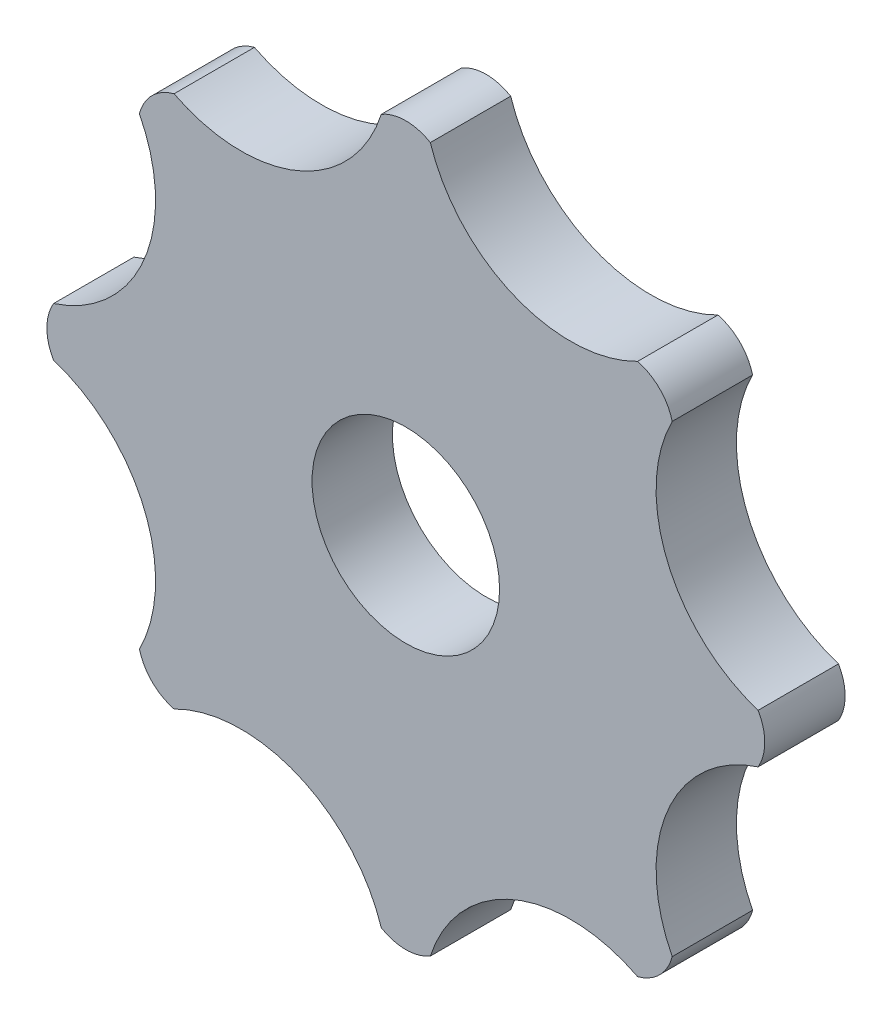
ISO-10303-21;
HEADER;
FILE_DESCRIPTION(('STEP AP214'),'2;1');
FILE_NAME('part.step','',(''),(''),'','','');
FILE_SCHEMA(('AUTOMOTIVE_DESIGN { 1 0 10303 214 1 1 1 1 }'));
ENDSEC;
DATA;
#1=APPLICATION_CONTEXT('core data for automotive mechanical design processes');
#2=APPLICATION_PROTOCOL_DEFINITION('international standard','automotive_design',2000,#1);
#3=PRODUCT_CONTEXT('',#1,'mechanical');
#4=PRODUCT('Part','Part','',(#3));
#5=PRODUCT_RELATED_PRODUCT_CATEGORY('part','',(#4));
#6=PRODUCT_DEFINITION_FORMATION('','',#4);
#7=PRODUCT_DEFINITION_CONTEXT('part definition',#1,'design');
#8=PRODUCT_DEFINITION('design','',#6,#7);
#9=PRODUCT_DEFINITION_SHAPE('','',#8);
#10=(LENGTH_UNIT() NAMED_UNIT(*) SI_UNIT(.MILLI.,.METRE.));
#11=(NAMED_UNIT(*) PLANE_ANGLE_UNIT() SI_UNIT($,.RADIAN.));
#12=(NAMED_UNIT(*) SI_UNIT($,.STERADIAN.) SOLID_ANGLE_UNIT());
#13=UNCERTAINTY_MEASURE_WITH_UNIT(LENGTH_MEASURE(1.E-05),#10,'distance_accuracy_value','');
#14=(GEOMETRIC_REPRESENTATION_CONTEXT(3) GLOBAL_UNCERTAINTY_ASSIGNED_CONTEXT((#13)) GLOBAL_UNIT_ASSIGNED_CONTEXT((#10,
#11,#12)) REPRESENTATION_CONTEXT('',''));
#15=CARTESIAN_POINT('',(0.,0.,0.));
#16=DIRECTION('',(0.,0.,1.));
#17=DIRECTION('',(1.,0.,0.));
#18=AXIS2_PLACEMENT_3D('',#15,#16,#17);
#19=CARTESIAN_POINT('',(14.8421246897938,6.14780934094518,3.));
#20=DIRECTION('',(0.,0.,-1.));
#21=DIRECTION('',(-1.,0.,0.));
#22=AXIS2_PLACEMENT_3D('',#19,#20,#21);
#23=CYLINDRICAL_SURFACE('',#22,5.5);
#24=CARTESIAN_POINT('',(14.8421246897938,6.14780934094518,0.));
#25=DIRECTION('',(0.,0.,-1.));
#26=DIRECTION('',(1.,0.,0.));
#27=AXIS2_PLACEMENT_3D('',#24,#25,#26);
#28=CIRCLE('',#27,5.5);
#29=CARTESIAN_POINT('',(13.1504175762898,0.914442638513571,0.));
#30=VERTEX_POINT('',#29);
#31=CARTESIAN_POINT('',(9.94535803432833,8.65214085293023,0.));
#32=VERTEX_POINT('',#31);
#33=EDGE_CURVE('E151',#30,#32,#28,.T.);
#34=ORIENTED_EDGE('',*,*,#33,.T.);
#35=DIRECTION('',(0.,0.,-1.));
#36=VECTOR('',#35,1.);
#37=CARTESIAN_POINT('',(9.94535803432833,8.65214085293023,3.));
#38=LINE('',#37,#36);
#39=CARTESIAN_POINT('',(9.94535803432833,8.65214085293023,3.));
#40=VERTEX_POINT('',#39);
#41=EDGE_CURVE('E12',#40,#32,#38,.T.);
#42=ORIENTED_EDGE('',*,*,#41,.F.);
#43=CARTESIAN_POINT('',(14.8421246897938,6.14780934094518,3.));
#44=DIRECTION('',(0.,0.,-1.));
#45=DIRECTION('',(1.,0.,0.));
#46=AXIS2_PLACEMENT_3D('',#43,#44,#45);
#47=CIRCLE('',#46,5.5);
#48=CARTESIAN_POINT('',(13.1504175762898,0.914442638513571,3.));
#49=VERTEX_POINT('',#48);
#50=EDGE_CURVE('E204',#49,#40,#47,.T.);
#51=ORIENTED_EDGE('',*,*,#50,.F.);
#52=DIRECTION('',(0.,0.,-1.));
#53=VECTOR('',#52,1.);
#54=CARTESIAN_POINT('',(13.1504175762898,0.914442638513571,3.));
#55=LINE('',#54,#53);
#56=EDGE_CURVE('E164',#49,#30,#55,.T.);
#57=ORIENTED_EDGE('',*,*,#56,.T.);
#58=EDGE_LOOP('',(#34,#42,#51,#57));
#59=FACE_BOUND('',#58,.T.);
#60=ADVANCED_FACE('F36',(#59),#23,.F.);
#61=CARTESIAN_POINT('',(8.20243866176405,8.20243866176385,3.));
#62=DIRECTION('',(0.,0.,-1.));
#63=DIRECTION('',(-1.,0.,0.));
#64=AXIS2_PLACEMENT_3D('',#61,#62,#63);
#65=CYLINDRICAL_SURFACE('',#64,1.8);
#66=CARTESIAN_POINT('',(8.20243866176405,8.20243866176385,0.));
#67=DIRECTION('',(0.,0.,1.));
#68=DIRECTION('',(1.,0.,0.));
#69=AXIS2_PLACEMENT_3D('',#66,#67,#68);
#70=CIRCLE('',#69,1.8);
#71=CARTESIAN_POINT('',(8.65214085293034,9.94535803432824,0.));
#72=VERTEX_POINT('',#71);
#73=EDGE_CURVE('E148',#32,#72,#70,.T.);
#74=ORIENTED_EDGE('',*,*,#73,.T.);
#75=DIRECTION('',(0.,0.,-1.));
#76=VECTOR('',#75,1.);
#77=CARTESIAN_POINT('',(8.65214085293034,9.94535803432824,3.));
#78=LINE('',#77,#76);
#79=CARTESIAN_POINT('',(8.65214085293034,9.94535803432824,3.));
#80=VERTEX_POINT('',#79);
#81=EDGE_CURVE('E43',#80,#72,#78,.T.);
#82=ORIENTED_EDGE('',*,*,#81,.F.);
#83=CARTESIAN_POINT('',(8.20243866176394,8.20243866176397,3.));
#84=DIRECTION('',(0.,0.,1.));
#85=DIRECTION('',(1.,0.,0.));
#86=AXIS2_PLACEMENT_3D('',#83,#84,#85);
#87=CIRCLE('',#86,1.8);
#88=EDGE_CURVE('E160',#40,#80,#87,.T.);
#89=ORIENTED_EDGE('',*,*,#88,.F.);
#90=ORIENTED_EDGE('',*,*,#41,.T.);
#91=EDGE_LOOP('',(#74,#82,#89,#90));
#92=FACE_BOUND('',#91,.T.);
#93=ADVANCED_FACE('F159',(#92),#65,.T.);
#94=CARTESIAN_POINT('',(6.14780934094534,14.8421246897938,3.));
#95=DIRECTION('',(0.,0.,-1.));
#96=DIRECTION('',(-1.,0.,0.));
#97=AXIS2_PLACEMENT_3D('',#94,#95,#96);
#98=CYLINDRICAL_SURFACE('',#97,5.5);
#99=CARTESIAN_POINT('',(6.14780934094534,14.8421246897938,0.));
#100=DIRECTION('',(0.,0.,-1.));
#101=DIRECTION('',(1.,0.,0.));
#102=AXIS2_PLACEMENT_3D('',#99,#100,#101);
#103=CIRCLE('',#102,5.5);
#104=CARTESIAN_POINT('',(0.914442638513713,13.1504175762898,0.));
#105=VERTEX_POINT('',#104);
#106=EDGE_CURVE('E153',#72,#105,#103,.T.);
#107=ORIENTED_EDGE('',*,*,#106,.T.);
#108=DIRECTION('',(0.,0.,-1.));
#109=VECTOR('',#108,1.);
#110=CARTESIAN_POINT('',(0.914442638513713,13.1504175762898,3.));
#111=LINE('',#110,#109);
#112=CARTESIAN_POINT('',(0.914442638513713,13.1504175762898,3.));
#113=VERTEX_POINT('',#112);
#114=EDGE_CURVE('E270',#113,#105,#111,.T.);
#115=ORIENTED_EDGE('',*,*,#114,.F.);
#116=CARTESIAN_POINT('',(6.14780934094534,14.8421246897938,3.));
#117=DIRECTION('',(0.,0.,-1.));
#118=DIRECTION('',(1.,0.,0.));
#119=AXIS2_PLACEMENT_3D('',#116,#117,#118);
#120=CIRCLE('',#119,5.5);
#121=EDGE_CURVE('E207',#80,#113,#120,.T.);
#122=ORIENTED_EDGE('',*,*,#121,.F.);
#123=ORIENTED_EDGE('',*,*,#81,.T.);
#124=EDGE_LOOP('',(#107,#115,#122,#123));
#125=FACE_BOUND('',#124,.T.);
#126=ADVANCED_FACE('F274',(#125),#98,.F.);
#127=CARTESIAN_POINT('',(1.21503620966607E-13,11.6,3.));
#128=DIRECTION('',(0.,0.,-1.));
#129=DIRECTION('',(-1.,0.,0.));
#130=AXIS2_PLACEMENT_3D('',#127,#128,#129);
#131=CYLINDRICAL_SURFACE('',#130,1.8);
#132=CARTESIAN_POINT('',(1.21503620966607E-13,11.6,0.));
#133=DIRECTION('',(0.,0.,1.));
#134=DIRECTION('',(1.,0.,0.));
#135=AXIS2_PLACEMENT_3D('',#132,#133,#134);
#136=CIRCLE('',#135,1.8);
#137=CARTESIAN_POINT('',(-0.914442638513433,13.1504175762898,0.));
#138=VERTEX_POINT('',#137);
#139=EDGE_CURVE('E172',#105,#138,#136,.T.);
#140=ORIENTED_EDGE('',*,*,#139,.T.);
#141=DIRECTION('',(0.,0.,-1.));
#142=VECTOR('',#141,1.);
#143=CARTESIAN_POINT('',(-0.914442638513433,13.1504175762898,3.));
#144=LINE('',#143,#142);
#145=CARTESIAN_POINT('',(-0.914442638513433,13.1504175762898,3.));
#146=VERTEX_POINT('',#145);
#147=EDGE_CURVE('E267',#146,#138,#144,.T.);
#148=ORIENTED_EDGE('',*,*,#147,.F.);
#149=CARTESIAN_POINT('',(1.20563281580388E-13,11.6,3.));
#150=DIRECTION('',(0.,0.,1.));
#151=DIRECTION('',(1.,0.,0.));
#152=AXIS2_PLACEMENT_3D('',#149,#150,#151);
#153=CIRCLE('',#152,1.8);
#154=EDGE_CURVE('E209',#113,#146,#153,.T.);
#155=ORIENTED_EDGE('',*,*,#154,.F.);
#156=ORIENTED_EDGE('',*,*,#114,.T.);
#157=EDGE_LOOP('',(#140,#148,#155,#156));
#158=FACE_BOUND('',#157,.T.);
#159=ADVANCED_FACE('F282',(#158),#131,.T.);
#160=CARTESIAN_POINT('',(-6.14780934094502,14.8421246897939,3.));
#161=DIRECTION('',(0.,0.,-1.));
#162=DIRECTION('',(-1.,0.,0.));
#163=AXIS2_PLACEMENT_3D('',#160,#161,#162);
#164=CYLINDRICAL_SURFACE('',#163,5.5);
#165=CARTESIAN_POINT('',(-6.14780934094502,14.8421246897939,0.));
#166=DIRECTION('',(0.,0.,-1.));
#167=DIRECTION('',(1.,0.,0.));
#168=AXIS2_PLACEMENT_3D('',#165,#166,#167);
#169=CIRCLE('',#168,5.5);
#170=CARTESIAN_POINT('',(-8.65214085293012,9.94535803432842,0.));
#171=VERTEX_POINT('',#170);
#172=EDGE_CURVE('E174',#138,#171,#169,.T.);
#173=ORIENTED_EDGE('',*,*,#172,.T.);
#174=DIRECTION('',(0.,0.,-1.));
#175=VECTOR('',#174,1.);
#176=CARTESIAN_POINT('',(-8.65214085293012,9.94535803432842,3.));
#177=LINE('',#176,#175);
#178=CARTESIAN_POINT('',(-8.65214085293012,9.94535803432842,3.));
#179=VERTEX_POINT('',#178);
#180=EDGE_CURVE('E264',#179,#171,#177,.T.);
#181=ORIENTED_EDGE('',*,*,#180,.F.);
#182=CARTESIAN_POINT('',(-6.14780934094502,14.8421246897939,3.));
#183=DIRECTION('',(0.,0.,-1.));
#184=DIRECTION('',(1.,0.,0.));
#185=AXIS2_PLACEMENT_3D('',#182,#183,#184);
#186=CIRCLE('',#185,5.5);
#187=EDGE_CURVE('E211',#146,#179,#186,.T.);
#188=ORIENTED_EDGE('',*,*,#187,.F.);
#189=ORIENTED_EDGE('',*,*,#147,.T.);
#190=EDGE_LOOP('',(#173,#181,#188,#189));
#191=FACE_BOUND('',#190,.T.);
#192=ADVANCED_FACE('F285',(#191),#164,.F.);
#193=CARTESIAN_POINT('',(-8.20243866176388,8.20243866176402,3.));
#194=DIRECTION('',(0.,0.,-1.));
#195=DIRECTION('',(-1.,0.,0.));
#196=AXIS2_PLACEMENT_3D('',#193,#194,#195);
#197=CYLINDRICAL_SURFACE('',#196,1.8);
#198=CARTESIAN_POINT('',(-8.20243866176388,8.20243866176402,0.));
#199=DIRECTION('',(0.,0.,1.));
#200=DIRECTION('',(1.,0.,0.));
#201=AXIS2_PLACEMENT_3D('',#198,#199,#200);
#202=CIRCLE('',#201,1.8);
#203=CARTESIAN_POINT('',(-9.94535803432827,8.6521408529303,0.));
#204=VERTEX_POINT('',#203);
#205=EDGE_CURVE('E177',#171,#204,#202,.T.);
#206=ORIENTED_EDGE('',*,*,#205,.T.);
#207=DIRECTION('',(0.,0.,-1.));
#208=VECTOR('',#207,1.);
#209=CARTESIAN_POINT('',(-9.94535803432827,8.6521408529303,3.));
#210=LINE('',#209,#208);
#211=CARTESIAN_POINT('',(-9.94535803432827,8.6521408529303,3.));
#212=VERTEX_POINT('',#211);
#213=EDGE_CURVE('E261',#212,#204,#210,.T.);
#214=ORIENTED_EDGE('',*,*,#213,.F.);
#215=CARTESIAN_POINT('',(-8.20243866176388,8.20243866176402,3.));
#216=DIRECTION('',(0.,0.,1.));
#217=DIRECTION('',(1.,0.,0.));
#218=AXIS2_PLACEMENT_3D('',#215,#216,#217);
#219=CIRCLE('',#218,1.8);
#220=EDGE_CURVE('E213',#179,#212,#219,.T.);
#221=ORIENTED_EDGE('',*,*,#220,.F.);
#222=ORIENTED_EDGE('',*,*,#180,.T.);
#223=EDGE_LOOP('',(#206,#214,#221,#222));
#224=FACE_BOUND('',#223,.T.);
#225=ADVANCED_FACE('F289',(#224),#197,.T.);
#226=CARTESIAN_POINT('',(-14.8421246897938,6.14780934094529,3.));
#227=DIRECTION('',(0.,0.,-1.));
#228=DIRECTION('',(-1.,0.,0.));
#229=AXIS2_PLACEMENT_3D('',#226,#227,#228);
#230=CYLINDRICAL_SURFACE('',#229,5.5);
#231=CARTESIAN_POINT('',(-14.8421246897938,6.14780934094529,0.));
#232=DIRECTION('',(0.,0.,-1.));
#233=DIRECTION('',(1.,0.,0.));
#234=AXIS2_PLACEMENT_3D('',#231,#232,#233);
#235=CIRCLE('',#234,5.5);
#236=CARTESIAN_POINT('',(-13.1504175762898,0.91444263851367,0.));
#237=VERTEX_POINT('',#236);
#238=EDGE_CURVE('E179',#204,#237,#235,.T.);
#239=ORIENTED_EDGE('',*,*,#238,.T.);
#240=DIRECTION('',(0.,0.,-1.));
#241=VECTOR('',#240,1.);
#242=CARTESIAN_POINT('',(-13.1504175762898,0.91444263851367,3.));
#243=LINE('',#242,#241);
#244=CARTESIAN_POINT('',(-13.1504175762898,0.91444263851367,3.));
#245=VERTEX_POINT('',#244);
#246=EDGE_CURVE('E258',#245,#237,#243,.T.);
#247=ORIENTED_EDGE('',*,*,#246,.F.);
#248=CARTESIAN_POINT('',(-14.8421246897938,6.14780934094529,3.));
#249=DIRECTION('',(0.,0.,-1.));
#250=DIRECTION('',(1.,0.,0.));
#251=AXIS2_PLACEMENT_3D('',#248,#249,#250);
#252=CIRCLE('',#251,5.5);
#253=EDGE_CURVE('E215',#212,#245,#252,.T.);
#254=ORIENTED_EDGE('',*,*,#253,.F.);
#255=ORIENTED_EDGE('',*,*,#213,.T.);
#256=EDGE_LOOP('',(#239,#247,#254,#255));
#257=FACE_BOUND('',#256,.T.);
#258=ADVANCED_FACE('F295',(#257),#230,.F.);
#259=CARTESIAN_POINT('',(-11.6,0.,3.));
#260=DIRECTION('',(0.,0.,-1.));
#261=DIRECTION('',(-1.,0.,0.));
#262=AXIS2_PLACEMENT_3D('',#259,#260,#261);
#263=CYLINDRICAL_SURFACE('',#262,1.8);
#264=CARTESIAN_POINT('',(-11.6,0.,0.));
#265=DIRECTION('',(0.,0.,1.));
#266=DIRECTION('',(1.,0.,0.));
#267=AXIS2_PLACEMENT_3D('',#264,#265,#266);
#268=CIRCLE('',#267,1.8);
#269=CARTESIAN_POINT('',(-13.1504175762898,-0.914442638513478,0.));
#270=VERTEX_POINT('',#269);
#271=EDGE_CURVE('E182',#237,#270,#268,.T.);
#272=ORIENTED_EDGE('',*,*,#271,.T.);
#273=DIRECTION('',(0.,0.,-1.));
#274=VECTOR('',#273,1.);
#275=CARTESIAN_POINT('',(-13.1504175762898,-0.914442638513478,3.));
#276=LINE('',#275,#274);
#277=CARTESIAN_POINT('',(-13.1504175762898,-0.914442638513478,3.));
#278=VERTEX_POINT('',#277);
#279=EDGE_CURVE('E255',#278,#270,#276,.T.);
#280=ORIENTED_EDGE('',*,*,#279,.F.);
#281=CARTESIAN_POINT('',(-11.6,0.,3.));
#282=DIRECTION('',(0.,0.,1.));
#283=DIRECTION('',(1.,0.,0.));
#284=AXIS2_PLACEMENT_3D('',#281,#282,#283);
#285=CIRCLE('',#284,1.8);
#286=EDGE_CURVE('E217',#245,#278,#285,.T.);
#287=ORIENTED_EDGE('',*,*,#286,.F.);
#288=ORIENTED_EDGE('',*,*,#246,.T.);
#289=EDGE_LOOP('',(#272,#280,#287,#288));
#290=FACE_BOUND('',#289,.T.);
#291=ADVANCED_FACE('F298',(#290),#263,.T.);
#292=CARTESIAN_POINT('',(-14.8421246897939,-6.14780934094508,3.));
#293=DIRECTION('',(0.,0.,-1.));
#294=DIRECTION('',(-1.,0.,0.));
#295=AXIS2_PLACEMENT_3D('',#292,#293,#294);
#296=CYLINDRICAL_SURFACE('',#295,5.5);
#297=CARTESIAN_POINT('',(-14.8421246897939,-6.14780934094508,0.));
#298=DIRECTION('',(0.,0.,-1.));
#299=DIRECTION('',(1.,0.,0.));
#300=AXIS2_PLACEMENT_3D('',#297,#298,#299);
#301=CIRCLE('',#300,5.5);
#302=CARTESIAN_POINT('',(-9.94535803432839,-8.65214085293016,0.));
#303=VERTEX_POINT('',#302);
#304=EDGE_CURVE('E184',#270,#303,#301,.T.);
#305=ORIENTED_EDGE('',*,*,#304,.T.);
#306=DIRECTION('',(0.,0.,-1.));
#307=VECTOR('',#306,1.);
#308=CARTESIAN_POINT('',(-9.94535803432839,-8.65214085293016,3.));
#309=LINE('',#308,#307);
#310=CARTESIAN_POINT('',(-9.94535803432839,-8.65214085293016,3.));
#311=VERTEX_POINT('',#310);
#312=EDGE_CURVE('E252',#311,#303,#309,.T.);
#313=ORIENTED_EDGE('',*,*,#312,.F.);
#314=CARTESIAN_POINT('',(-14.8421246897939,-6.14780934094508,3.));
#315=DIRECTION('',(0.,0.,-1.));
#316=DIRECTION('',(1.,0.,0.));
#317=AXIS2_PLACEMENT_3D('',#314,#315,#316);
#318=CIRCLE('',#317,5.5);
#319=EDGE_CURVE('E219',#278,#311,#318,.T.);
#320=ORIENTED_EDGE('',*,*,#319,.F.);
#321=ORIENTED_EDGE('',*,*,#279,.T.);
#322=EDGE_LOOP('',(#305,#313,#320,#321));
#323=FACE_BOUND('',#322,.T.);
#324=ADVANCED_FACE('F303',(#323),#296,.F.);
#325=CARTESIAN_POINT('',(-8.20243866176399,-8.20243866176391,3.));
#326=DIRECTION('',(0.,0.,-1.));
#327=DIRECTION('',(-1.,0.,0.));
#328=AXIS2_PLACEMENT_3D('',#325,#326,#327);
#329=CYLINDRICAL_SURFACE('',#328,1.8);
#330=CARTESIAN_POINT('',(-8.20243866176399,-8.20243866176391,0.));
#331=DIRECTION('',(0.,0.,1.));
#332=DIRECTION('',(1.,0.,0.));
#333=AXIS2_PLACEMENT_3D('',#330,#331,#332);
#334=CIRCLE('',#333,1.8);
#335=CARTESIAN_POINT('',(-8.65214085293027,-9.9453580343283,0.));
#336=VERTEX_POINT('',#335);
#337=EDGE_CURVE('E187',#303,#336,#334,.T.);
#338=ORIENTED_EDGE('',*,*,#337,.T.);
#339=DIRECTION('',(0.,0.,-1.));
#340=VECTOR('',#339,1.);
#341=CARTESIAN_POINT('',(-8.65214085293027,-9.9453580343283,3.));
#342=LINE('',#341,#340);
#343=CARTESIAN_POINT('',(-8.65214085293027,-9.9453580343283,3.));
#344=VERTEX_POINT('',#343);
#345=EDGE_CURVE('E249',#344,#336,#342,.T.);
#346=ORIENTED_EDGE('',*,*,#345,.F.);
#347=CARTESIAN_POINT('',(-8.20243866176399,-8.20243866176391,3.));
#348=DIRECTION('',(0.,0.,1.));
#349=DIRECTION('',(1.,0.,0.));
#350=AXIS2_PLACEMENT_3D('',#347,#348,#349);
#351=CIRCLE('',#350,1.8);
#352=EDGE_CURVE('E221',#311,#344,#351,.T.);
#353=ORIENTED_EDGE('',*,*,#352,.F.);
#354=ORIENTED_EDGE('',*,*,#312,.T.);
#355=EDGE_LOOP('',(#338,#346,#353,#354));
#356=FACE_BOUND('',#355,.T.);
#357=ADVANCED_FACE('F309',(#356),#329,.T.);
#358=CARTESIAN_POINT('',(-6.14780934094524,-14.8421246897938,3.));
#359=DIRECTION('',(0.,0.,-1.));
#360=DIRECTION('',(-1.,0.,0.));
#361=AXIS2_PLACEMENT_3D('',#358,#359,#360);
#362=CYLINDRICAL_SURFACE('',#361,5.5);
#363=CARTESIAN_POINT('',(-6.14780934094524,-14.8421246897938,0.));
#364=DIRECTION('',(0.,0.,-1.));
#365=DIRECTION('',(1.,0.,0.));
#366=AXIS2_PLACEMENT_3D('',#363,#364,#365);
#367=CIRCLE('',#366,5.5);
#368=CARTESIAN_POINT('',(-0.914442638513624,-13.1504175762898,0.));
#369=VERTEX_POINT('',#368);
#370=EDGE_CURVE('E189',#336,#369,#367,.T.);
#371=ORIENTED_EDGE('',*,*,#370,.T.);
#372=DIRECTION('',(0.,0.,-1.));
#373=VECTOR('',#372,1.);
#374=CARTESIAN_POINT('',(-0.914442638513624,-13.1504175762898,3.));
#375=LINE('',#374,#373);
#376=CARTESIAN_POINT('',(-0.914442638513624,-13.1504175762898,3.));
#377=VERTEX_POINT('',#376);
#378=EDGE_CURVE('E246',#377,#369,#375,.T.);
#379=ORIENTED_EDGE('',*,*,#378,.F.);
#380=CARTESIAN_POINT('',(-6.14780934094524,-14.8421246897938,3.));
#381=DIRECTION('',(0.,0.,-1.));
#382=DIRECTION('',(1.,0.,0.));
#383=AXIS2_PLACEMENT_3D('',#380,#381,#382);
#384=CIRCLE('',#383,5.5);
#385=EDGE_CURVE('E223',#344,#377,#384,.T.);
#386=ORIENTED_EDGE('',*,*,#385,.F.);
#387=ORIENTED_EDGE('',*,*,#345,.T.);
#388=EDGE_LOOP('',(#371,#379,#386,#387));
#389=FACE_BOUND('',#388,.T.);
#390=ADVANCED_FACE('F312',(#389),#362,.F.);
#391=CARTESIAN_POINT('',(0.,-11.6,3.));
#392=DIRECTION('',(0.,0.,-1.));
#393=DIRECTION('',(-1.,0.,0.));
#394=AXIS2_PLACEMENT_3D('',#391,#392,#393);
#395=CYLINDRICAL_SURFACE('',#394,1.8);
#396=CARTESIAN_POINT('',(0.,-11.6,0.));
#397=DIRECTION('',(0.,0.,1.));
#398=DIRECTION('',(1.,0.,0.));
#399=AXIS2_PLACEMENT_3D('',#396,#397,#398);
#400=CIRCLE('',#399,1.8);
#401=CARTESIAN_POINT('',(0.914442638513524,-13.1504175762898,0.));
#402=VERTEX_POINT('',#401);
#403=EDGE_CURVE('E192',#369,#402,#400,.T.);
#404=ORIENTED_EDGE('',*,*,#403,.T.);
#405=DIRECTION('',(0.,0.,-1.));
#406=VECTOR('',#405,1.);
#407=CARTESIAN_POINT('',(0.914442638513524,-13.1504175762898,3.));
#408=LINE('',#407,#406);
#409=CARTESIAN_POINT('',(0.914442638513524,-13.1504175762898,3.));
#410=VERTEX_POINT('',#409);
#411=EDGE_CURVE('E243',#410,#402,#408,.T.);
#412=ORIENTED_EDGE('',*,*,#411,.F.);
#413=CARTESIAN_POINT('',(0.,-11.6,3.));
#414=DIRECTION('',(0.,0.,1.));
#415=DIRECTION('',(1.,0.,0.));
#416=AXIS2_PLACEMENT_3D('',#413,#414,#415);
#417=CIRCLE('',#416,1.8);
#418=EDGE_CURVE('E225',#377,#410,#417,.T.);
#419=ORIENTED_EDGE('',*,*,#418,.F.);
#420=ORIENTED_EDGE('',*,*,#378,.T.);
#421=EDGE_LOOP('',(#404,#412,#419,#420));
#422=FACE_BOUND('',#421,.T.);
#423=ADVANCED_FACE('F316',(#422),#395,.T.);
#424=CARTESIAN_POINT('',(6.14780934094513,-14.8421246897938,3.));
#425=DIRECTION('',(0.,0.,-1.));
#426=DIRECTION('',(-1.,0.,0.));
#427=AXIS2_PLACEMENT_3D('',#424,#425,#426);
#428=CYLINDRICAL_SURFACE('',#427,5.5);
#429=CARTESIAN_POINT('',(6.14780934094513,-14.8421246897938,0.));
#430=DIRECTION('',(0.,0.,-1.));
#431=DIRECTION('',(1.,0.,0.));
#432=AXIS2_PLACEMENT_3D('',#429,#430,#431);
#433=CIRCLE('',#432,5.5);
#434=CARTESIAN_POINT('',(8.65214085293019,-9.94535803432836,0.));
#435=VERTEX_POINT('',#434);
#436=EDGE_CURVE('E194',#402,#435,#433,.T.);
#437=ORIENTED_EDGE('',*,*,#436,.T.);
#438=DIRECTION('',(0.,0.,-1.));
#439=VECTOR('',#438,1.);
#440=CARTESIAN_POINT('',(8.65214085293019,-9.94535803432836,3.));
#441=LINE('',#440,#439);
#442=CARTESIAN_POINT('',(8.65214085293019,-9.94535803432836,3.));
#443=VERTEX_POINT('',#442);
#444=EDGE_CURVE('E240',#443,#435,#441,.T.);
#445=ORIENTED_EDGE('',*,*,#444,.F.);
#446=CARTESIAN_POINT('',(6.14780934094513,-14.8421246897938,3.));
#447=DIRECTION('',(0.,0.,-1.));
#448=DIRECTION('',(1.,0.,0.));
#449=AXIS2_PLACEMENT_3D('',#446,#447,#448);
#450=CIRCLE('',#449,5.5);
#451=EDGE_CURVE('E227',#410,#443,#450,.T.);
#452=ORIENTED_EDGE('',*,*,#451,.F.);
#453=ORIENTED_EDGE('',*,*,#411,.T.);
#454=EDGE_LOOP('',(#437,#445,#452,#453));
#455=FACE_BOUND('',#454,.T.);
#456=ADVANCED_FACE('F322',(#455),#428,.F.);
#457=CARTESIAN_POINT('',(8.20243866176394,-8.20243866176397,3.));
#458=DIRECTION('',(0.,0.,-1.));
#459=DIRECTION('',(-1.,0.,0.));
#460=AXIS2_PLACEMENT_3D('',#457,#458,#459);
#461=CYLINDRICAL_SURFACE('',#460,1.8);
#462=CARTESIAN_POINT('',(8.20243866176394,-8.20243866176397,0.));
#463=DIRECTION('',(0.,0.,1.));
#464=DIRECTION('',(1.,0.,0.));
#465=AXIS2_PLACEMENT_3D('',#462,#463,#464);
#466=CIRCLE('',#465,1.8);
#467=CARTESIAN_POINT('',(9.94535803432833,-8.65214085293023,0.));
#468=VERTEX_POINT('',#467);
#469=EDGE_CURVE('E197',#435,#468,#466,.T.);
#470=ORIENTED_EDGE('',*,*,#469,.T.);
#471=DIRECTION('',(0.,0.,-1.));
#472=VECTOR('',#471,1.);
#473=CARTESIAN_POINT('',(9.94535803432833,-8.65214085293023,3.));
#474=LINE('',#473,#472);
#475=CARTESIAN_POINT('',(9.94535803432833,-8.65214085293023,3.));
#476=VERTEX_POINT('',#475);
#477=EDGE_CURVE('E237',#476,#468,#474,.T.);
#478=ORIENTED_EDGE('',*,*,#477,.F.);
#479=CARTESIAN_POINT('',(8.20243866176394,-8.20243866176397,3.));
#480=DIRECTION('',(0.,0.,1.));
#481=DIRECTION('',(1.,0.,0.));
#482=AXIS2_PLACEMENT_3D('',#479,#480,#481);
#483=CIRCLE('',#482,1.8);
#484=EDGE_CURVE('E229',#443,#476,#483,.T.);
#485=ORIENTED_EDGE('',*,*,#484,.F.);
#486=ORIENTED_EDGE('',*,*,#444,.T.);
#487=EDGE_LOOP('',(#470,#478,#485,#486));
#488=FACE_BOUND('',#487,.T.);
#489=ADVANCED_FACE('F325',(#488),#461,.T.);
#490=CARTESIAN_POINT('',(14.8421246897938,-6.14780934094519,3.));
#491=DIRECTION('',(0.,0.,-1.));
#492=DIRECTION('',(-1.,0.,0.));
#493=AXIS2_PLACEMENT_3D('',#490,#491,#492);
#494=CYLINDRICAL_SURFACE('',#493,5.5);
#495=CARTESIAN_POINT('',(14.8421246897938,-6.14780934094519,0.));
#496=DIRECTION('',(0.,0.,-1.));
#497=DIRECTION('',(1.,0.,0.));
#498=AXIS2_PLACEMENT_3D('',#495,#496,#497);
#499=CIRCLE('',#498,5.5);
#500=CARTESIAN_POINT('',(13.1504175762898,-0.914442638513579,0.));
#501=VERTEX_POINT('',#500);
#502=EDGE_CURVE('E199',#468,#501,#499,.T.);
#503=ORIENTED_EDGE('',*,*,#502,.T.);
#504=DIRECTION('',(0.,0.,-1.));
#505=VECTOR('',#504,1.);
#506=CARTESIAN_POINT('',(13.1504175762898,-0.914442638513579,3.));
#507=LINE('',#506,#505);
#508=CARTESIAN_POINT('',(13.1504175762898,-0.914442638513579,3.));
#509=VERTEX_POINT('',#508);
#510=EDGE_CURVE('E234',#509,#501,#507,.T.);
#511=ORIENTED_EDGE('',*,*,#510,.F.);
#512=CARTESIAN_POINT('',(14.8421246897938,-6.14780934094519,3.));
#513=DIRECTION('',(0.,0.,-1.));
#514=DIRECTION('',(1.,0.,0.));
#515=AXIS2_PLACEMENT_3D('',#512,#513,#514);
#516=CIRCLE('',#515,5.5);
#517=EDGE_CURVE('E55',#476,#509,#516,.T.);
#518=ORIENTED_EDGE('',*,*,#517,.F.);
#519=ORIENTED_EDGE('',*,*,#477,.T.);
#520=EDGE_LOOP('',(#503,#511,#518,#519));
#521=FACE_BOUND('',#520,.T.);
#522=ADVANCED_FACE('F328',(#521),#494,.F.);
#523=CARTESIAN_POINT('',(11.6,0.,3.));
#524=DIRECTION('',(0.,0.,-1.));
#525=DIRECTION('',(-1.,0.,0.));
#526=AXIS2_PLACEMENT_3D('',#523,#524,#525);
#527=CYLINDRICAL_SURFACE('',#526,1.8);
#528=CARTESIAN_POINT('',(11.6,0.,0.));
#529=DIRECTION('',(0.,0.,1.));
#530=DIRECTION('',(1.,0.,0.));
#531=AXIS2_PLACEMENT_3D('',#528,#529,#530);
#532=CIRCLE('',#531,1.8);
#533=EDGE_CURVE('E202',#501,#30,#532,.T.);
#534=ORIENTED_EDGE('',*,*,#533,.T.);
#535=ORIENTED_EDGE('',*,*,#56,.F.);
#536=CARTESIAN_POINT('',(11.6,0.,3.));
#537=DIRECTION('',(0.,0.,1.));
#538=DIRECTION('',(1.,0.,0.));
#539=AXIS2_PLACEMENT_3D('',#536,#537,#538);
#540=CIRCLE('',#539,1.8);
#541=EDGE_CURVE('E50',#509,#49,#540,.T.);
#542=ORIENTED_EDGE('',*,*,#541,.F.);
#543=ORIENTED_EDGE('',*,*,#510,.T.);
#544=EDGE_LOOP('',(#534,#535,#542,#543));
#545=FACE_BOUND('',#544,.T.);
#546=ADVANCED_FACE('F330',(#545),#527,.T.);
#547=CARTESIAN_POINT('',(13.2210623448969,3.07390467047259,3.));
#548=DIRECTION('',(0.,0.,1.));
#549=DIRECTION('',(1.,0.,0.));
#550=AXIS2_PLACEMENT_3D('',#547,#548,#549);
#551=PLANE('',#550);
#552=CARTESIAN_POINT('',(0.,0.,3.));
#553=DIRECTION('',(0.,0.,1.));
#554=DIRECTION('',(1.,0.,0.));
#555=AXIS2_PLACEMENT_3D('',#552,#553,#554);
#556=CIRCLE('',#555,3.5);
#557=CARTESIAN_POINT('',(3.5,0.,3.));
#558=VERTEX_POINT('',#557);
#559=EDGE_CURVE('E168',#558,#558,#556,.T.);
#560=ORIENTED_EDGE('',*,*,#559,.F.);
#561=EDGE_LOOP('',(#560));
#562=FACE_BOUND('',#561,.T.);
#563=ORIENTED_EDGE('',*,*,#50,.T.);
#564=ORIENTED_EDGE('',*,*,#88,.T.);
#565=ORIENTED_EDGE('',*,*,#121,.T.);
#566=ORIENTED_EDGE('',*,*,#154,.T.);
#567=ORIENTED_EDGE('',*,*,#187,.T.);
#568=ORIENTED_EDGE('',*,*,#220,.T.);
#569=ORIENTED_EDGE('',*,*,#253,.T.);
#570=ORIENTED_EDGE('',*,*,#286,.T.);
#571=ORIENTED_EDGE('',*,*,#319,.T.);
#572=ORIENTED_EDGE('',*,*,#352,.T.);
#573=ORIENTED_EDGE('',*,*,#385,.T.);
#574=ORIENTED_EDGE('',*,*,#418,.T.);
#575=ORIENTED_EDGE('',*,*,#451,.T.);
#576=ORIENTED_EDGE('',*,*,#484,.T.);
#577=ORIENTED_EDGE('',*,*,#517,.T.);
#578=ORIENTED_EDGE('',*,*,#541,.T.);
#579=EDGE_LOOP('',(#563,#564,#565,#566,#567,#568,#569,#570,#571,#572,#573,#574,#575,#576,#577,#578));
#580=FACE_BOUND('',#579,.T.);
#581=ADVANCED_FACE('F277',(#562,#580),#551,.T.);
#582=CARTESIAN_POINT('',(13.2210623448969,3.07390467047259,0.));
#583=DIRECTION('',(0.,0.,1.));
#584=DIRECTION('',(1.,0.,0.));
#585=AXIS2_PLACEMENT_3D('',#582,#583,#584);
#586=PLANE('',#585);
#587=CARTESIAN_POINT('',(0.,0.,0.));
#588=DIRECTION('',(0.,0.,1.));
#589=DIRECTION('',(1.,0.,0.));
#590=AXIS2_PLACEMENT_3D('',#587,#588,#589);
#591=CIRCLE('',#590,3.5);
#592=CARTESIAN_POINT('',(3.5,0.,0.));
#593=VERTEX_POINT('',#592);
#594=EDGE_CURVE('E165',#593,#593,#591,.T.);
#595=ORIENTED_EDGE('',*,*,#594,.T.);
#596=EDGE_LOOP('',(#595));
#597=FACE_BOUND('',#596,.T.);
#598=ORIENTED_EDGE('',*,*,#33,.F.);
#599=ORIENTED_EDGE('',*,*,#533,.F.);
#600=ORIENTED_EDGE('',*,*,#502,.F.);
#601=ORIENTED_EDGE('',*,*,#469,.F.);
#602=ORIENTED_EDGE('',*,*,#436,.F.);
#603=ORIENTED_EDGE('',*,*,#403,.F.);
#604=ORIENTED_EDGE('',*,*,#370,.F.);
#605=ORIENTED_EDGE('',*,*,#337,.F.);
#606=ORIENTED_EDGE('',*,*,#304,.F.);
#607=ORIENTED_EDGE('',*,*,#271,.F.);
#608=ORIENTED_EDGE('',*,*,#238,.F.);
#609=ORIENTED_EDGE('',*,*,#205,.F.);
#610=ORIENTED_EDGE('',*,*,#172,.F.);
#611=ORIENTED_EDGE('',*,*,#139,.F.);
#612=ORIENTED_EDGE('',*,*,#106,.F.);
#613=ORIENTED_EDGE('',*,*,#73,.F.);
#614=EDGE_LOOP('',(#598,#599,#600,#601,#602,#603,#604,#605,#606,#607,#608,#609,#610,#611,#612,#613));
#615=FACE_BOUND('',#614,.T.);
#616=ADVANCED_FACE('F149',(#597,#615),#586,.F.);
#617=CARTESIAN_POINT('',(0.,0.,0.));
#618=DIRECTION('',(0.,0.,1.));
#619=DIRECTION('',(1.,0.,0.));
#620=AXIS2_PLACEMENT_3D('',#617,#618,#619);
#621=CYLINDRICAL_SURFACE('',#620,3.5);
#622=ORIENTED_EDGE('',*,*,#594,.F.);
#623=EDGE_LOOP('',(#622));
#624=FACE_BOUND('',#623,.T.);
#625=ORIENTED_EDGE('',*,*,#559,.T.);
#626=EDGE_LOOP('',(#625));
#627=FACE_BOUND('',#626,.T.);
#628=ADVANCED_FACE('F395',(#624,#627),#621,.F.);
#629=CLOSED_SHELL('',(#60,#93,#126,#159,#192,#225,#258,#291,#324,#357,#390,#423,#456,#489,#522,
#546,#581,#616,#628));
#630=MANIFOLD_SOLID_BREP('B2',#629);
#631=ADVANCED_BREP_SHAPE_REPRESENTATION('',(#18,#630),#14);
#632=SHAPE_DEFINITION_REPRESENTATION(#9,#631);
ENDSEC;
END-ISO-10303-21;
